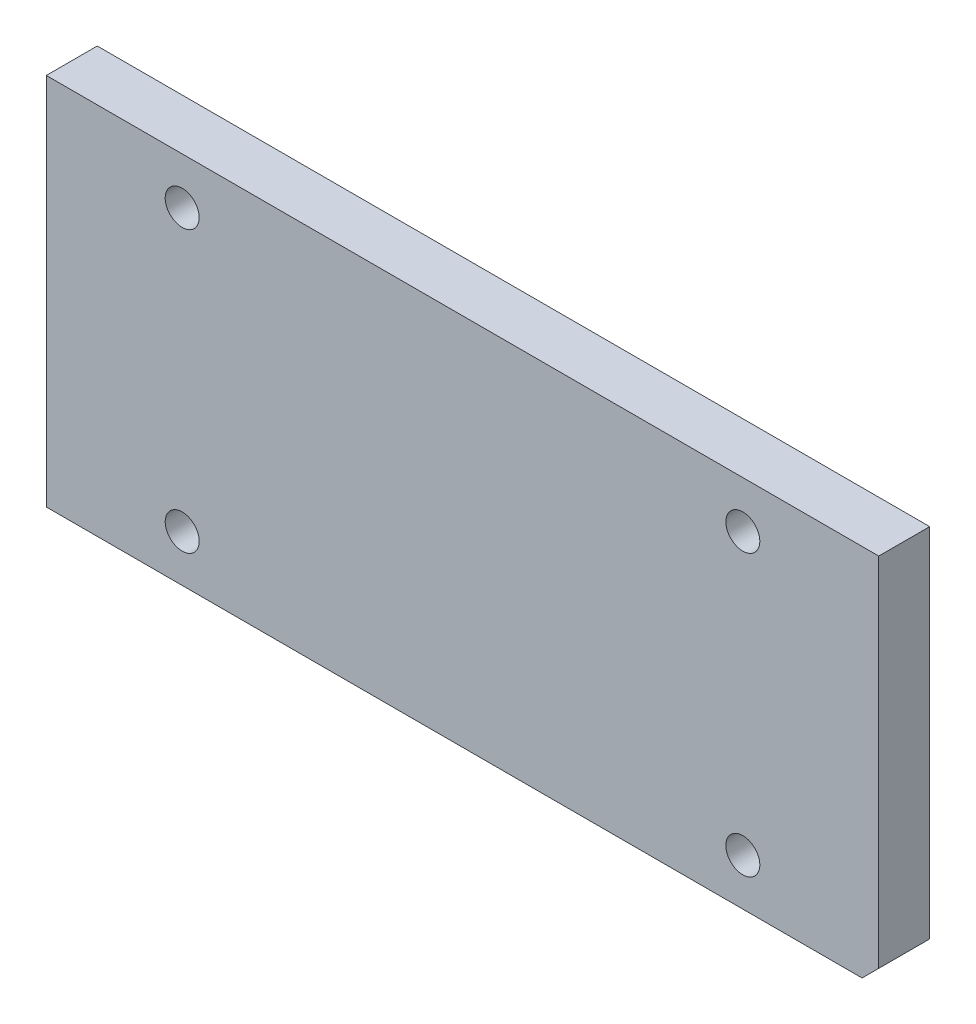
ISO-10303-21;
HEADER;
FILE_DESCRIPTION(('STEP AP214'),'2;1');
FILE_NAME('part.step','',(''),(''),'','','');
FILE_SCHEMA(('AUTOMOTIVE_DESIGN { 1 0 10303 214 1 1 1 1 }'));
ENDSEC;
DATA;
#1=APPLICATION_CONTEXT('core data for automotive mechanical design processes');
#2=APPLICATION_PROTOCOL_DEFINITION('international standard','automotive_design',2000,#1);
#3=PRODUCT_CONTEXT('',#1,'mechanical');
#4=PRODUCT('Part','Part','',(#3));
#5=PRODUCT_RELATED_PRODUCT_CATEGORY('part','',(#4));
#6=PRODUCT_DEFINITION_FORMATION('','',#4);
#7=PRODUCT_DEFINITION_CONTEXT('part definition',#1,'design');
#8=PRODUCT_DEFINITION('design','',#6,#7);
#9=PRODUCT_DEFINITION_SHAPE('','',#8);
#10=(LENGTH_UNIT() NAMED_UNIT(*) SI_UNIT(.MILLI.,.METRE.));
#11=(NAMED_UNIT(*) PLANE_ANGLE_UNIT() SI_UNIT($,.RADIAN.));
#12=(NAMED_UNIT(*) SI_UNIT($,.STERADIAN.) SOLID_ANGLE_UNIT());
#13=UNCERTAINTY_MEASURE_WITH_UNIT(LENGTH_MEASURE(1.E-05),#10,'distance_accuracy_value','');
#14=(GEOMETRIC_REPRESENTATION_CONTEXT(3) GLOBAL_UNCERTAINTY_ASSIGNED_CONTEXT((#13)) GLOBAL_UNIT_ASSIGNED_CONTEXT((#10,
#11,#12)) REPRESENTATION_CONTEXT('',''));
#15=CARTESIAN_POINT('',(0.,0.,0.));
#16=DIRECTION('',(0.,0.,1.));
#17=DIRECTION('',(1.,0.,0.));
#18=AXIS2_PLACEMENT_3D('',#15,#16,#17);
#19=CARTESIAN_POINT('',(-98.,-44.,-226.848784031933));
#20=DIRECTION('',(-1.,0.,0.));
#21=DIRECTION('',(0.,0.,1.));
#22=AXIS2_PLACEMENT_3D('',#19,#20,#21);
#23=PLANE('',#22);
#24=DIRECTION('',(0.,1.,0.));
#25=VECTOR('',#24,1.);
#26=CARTESIAN_POINT('',(-98.,-44.,-12.));
#27=LINE('',#26,#25);
#28=CARTESIAN_POINT('',(-98.,-44.,-12.));
#29=VERTEX_POINT('',#28);
#30=CARTESIAN_POINT('',(-98.,44.,-12.));
#31=VERTEX_POINT('',#30);
#32=EDGE_CURVE('E87',#29,#31,#27,.T.);
#33=ORIENTED_EDGE('',*,*,#32,.F.);
#34=DIRECTION('',(0.,0.,1.));
#35=VECTOR('',#34,1.);
#36=CARTESIAN_POINT('',(-98.,-44.,-226.848784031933));
#37=LINE('',#36,#35);
#38=CARTESIAN_POINT('',(-98.,-44.,0.));
#39=VERTEX_POINT('',#38);
#40=EDGE_CURVE('E81',#29,#39,#37,.T.);
#41=ORIENTED_EDGE('',*,*,#40,.T.);
#42=DIRECTION('',(0.,-1.,0.));
#43=VECTOR('',#42,1.);
#44=CARTESIAN_POINT('',(-98.,-44.,0.));
#45=LINE('',#44,#43);
#46=CARTESIAN_POINT('',(-98.,44.,0.));
#47=VERTEX_POINT('',#46);
#48=EDGE_CURVE('E85',#47,#39,#45,.T.);
#49=ORIENTED_EDGE('',*,*,#48,.F.);
#50=DIRECTION('',(0.,0.,1.));
#51=VECTOR('',#50,1.);
#52=CARTESIAN_POINT('',(-98.,44.,-226.848784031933));
#53=LINE('',#52,#51);
#54=EDGE_CURVE('E112',#31,#47,#53,.T.);
#55=ORIENTED_EDGE('',*,*,#54,.F.);
#56=EDGE_LOOP('',(#33,#41,#49,#55));
#57=FACE_BOUND('',#56,.T.);
#58=ADVANCED_FACE('F34',(#57),#23,.T.);
#59=CARTESIAN_POINT('',(-98.,44.,-226.848784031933));
#60=DIRECTION('',(0.,1.,0.));
#61=DIRECTION('',(0.,0.,1.));
#62=AXIS2_PLACEMENT_3D('',#59,#60,#61);
#63=PLANE('',#62);
#64=DIRECTION('',(1.,0.,0.));
#65=VECTOR('',#64,1.);
#66=CARTESIAN_POINT('',(-98.,44.,-12.));
#67=LINE('',#66,#65);
#68=CARTESIAN_POINT('',(98.,44.,-12.));
#69=VERTEX_POINT('',#68);
#70=EDGE_CURVE('E168',#31,#69,#67,.T.);
#71=ORIENTED_EDGE('',*,*,#70,.F.);
#72=ORIENTED_EDGE('',*,*,#54,.T.);
#73=DIRECTION('',(-1.,0.,0.));
#74=VECTOR('',#73,1.);
#75=CARTESIAN_POINT('',(-98.,44.,0.));
#76=LINE('',#75,#74);
#77=CARTESIAN_POINT('',(98.,44.,0.));
#78=VERTEX_POINT('',#77);
#79=EDGE_CURVE('E91',#78,#47,#76,.T.);
#80=ORIENTED_EDGE('',*,*,#79,.F.);
#81=DIRECTION('',(0.,0.,1.));
#82=VECTOR('',#81,1.);
#83=CARTESIAN_POINT('',(98.,44.,-226.848784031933));
#84=LINE('',#83,#82);
#85=EDGE_CURVE('E90',#69,#78,#84,.T.);
#86=ORIENTED_EDGE('',*,*,#85,.F.);
#87=EDGE_LOOP('',(#71,#72,#80,#86));
#88=FACE_BOUND('',#87,.T.);
#89=ADVANCED_FACE('F174',(#88),#63,.T.);
#90=CARTESIAN_POINT('',(98.,-44.,-226.848784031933));
#91=DIRECTION('',(1.,0.,0.));
#92=DIRECTION('',(0.,1.,0.));
#93=AXIS2_PLACEMENT_3D('',#90,#91,#92);
#94=PLANE('',#93);
#95=DIRECTION('',(0.,1.,0.));
#96=VECTOR('',#95,1.);
#97=CARTESIAN_POINT('',(98.,-44.,0.));
#98=LINE('',#97,#96);
#99=CARTESIAN_POINT('',(98.,-40.08,0.));
#100=VERTEX_POINT('',#99);
#101=EDGE_CURVE('E98',#100,#78,#98,.T.);
#102=ORIENTED_EDGE('',*,*,#101,.F.);
#103=DIRECTION('',(0.,0.,-1.));
#104=VECTOR('',#103,1.);
#105=CARTESIAN_POINT('',(98.,-40.08,-226.848784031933));
#106=LINE('',#105,#104);
#107=CARTESIAN_POINT('',(98.,-40.08,-12.));
#108=VERTEX_POINT('',#107);
#109=EDGE_CURVE('E42',#100,#108,#106,.T.);
#110=ORIENTED_EDGE('',*,*,#109,.T.);
#111=DIRECTION('',(0.,-1.,0.));
#112=VECTOR('',#111,1.);
#113=CARTESIAN_POINT('',(98.,-44.,-12.));
#114=LINE('',#113,#112);
#115=EDGE_CURVE('E114',#69,#108,#114,.T.);
#116=ORIENTED_EDGE('',*,*,#115,.F.);
#117=ORIENTED_EDGE('',*,*,#85,.T.);
#118=EDGE_LOOP('',(#102,#110,#116,#117));
#119=FACE_BOUND('',#118,.T.);
#120=ADVANCED_FACE('F175',(#119),#94,.T.);
#121=CARTESIAN_POINT('',(-98.,-44.,-226.848784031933));
#122=DIRECTION('',(0.,-1.,0.));
#123=DIRECTION('',(0.,0.,-1.));
#124=AXIS2_PLACEMENT_3D('',#121,#122,#123);
#125=PLANE('',#124);
#126=DIRECTION('',(-1.,0.,0.));
#127=VECTOR('',#126,1.);
#128=CARTESIAN_POINT('',(-98.,-44.,-12.));
#129=LINE('',#128,#127);
#130=CARTESIAN_POINT('',(94.08,-44.,-12.));
#131=VERTEX_POINT('',#130);
#132=EDGE_CURVE('E117',#131,#29,#129,.T.);
#133=ORIENTED_EDGE('',*,*,#132,.F.);
#134=DIRECTION('',(0.,0.,1.));
#135=VECTOR('',#134,1.);
#136=CARTESIAN_POINT('',(94.08,-44.,-226.848784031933));
#137=LINE('',#136,#135);
#138=CARTESIAN_POINT('',(94.08,-44.,0.));
#139=VERTEX_POINT('',#138);
#140=EDGE_CURVE('E97',#131,#139,#137,.T.);
#141=ORIENTED_EDGE('',*,*,#140,.T.);
#142=DIRECTION('',(1.,0.,0.));
#143=VECTOR('',#142,1.);
#144=CARTESIAN_POINT('',(-98.,-44.,0.));
#145=LINE('',#144,#143);
#146=EDGE_CURVE('E94',#39,#139,#145,.T.);
#147=ORIENTED_EDGE('',*,*,#146,.F.);
#148=ORIENTED_EDGE('',*,*,#40,.F.);
#149=EDGE_LOOP('',(#133,#141,#147,#148));
#150=FACE_BOUND('',#149,.T.);
#151=ADVANCED_FACE('F95',(#150),#125,.T.);
#152=CARTESIAN_POINT('',(0.,0.,0.));
#153=DIRECTION('',(0.,0.,-1.));
#154=DIRECTION('',(-1.,0.,0.));
#155=AXIS2_PLACEMENT_3D('',#152,#153,#154);
#156=PLANE('',#155);
#157=CARTESIAN_POINT('',(66.0000000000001,-33.,0.));
#158=DIRECTION('',(0.,0.,1.));
#159=DIRECTION('',(1.,0.,0.));
#160=AXIS2_PLACEMENT_3D('',#157,#158,#159);
#161=CIRCLE('',#160,4.);
#162=CARTESIAN_POINT('',(70.0000000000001,-33.,0.));
#163=VERTEX_POINT('',#162);
#164=EDGE_CURVE('E146',#163,#163,#161,.T.);
#165=ORIENTED_EDGE('',*,*,#164,.F.);
#166=EDGE_LOOP('',(#165));
#167=FACE_BOUND('',#166,.T.);
#168=CARTESIAN_POINT('',(-65.9999999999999,-33.,0.));
#169=DIRECTION('',(0.,0.,1.));
#170=DIRECTION('',(1.,0.,0.));
#171=AXIS2_PLACEMENT_3D('',#168,#169,#170);
#172=CIRCLE('',#171,4.);
#173=CARTESIAN_POINT('',(-61.9999999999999,-33.,0.));
#174=VERTEX_POINT('',#173);
#175=EDGE_CURVE('E132',#174,#174,#172,.T.);
#176=ORIENTED_EDGE('',*,*,#175,.F.);
#177=EDGE_LOOP('',(#176));
#178=FACE_BOUND('',#177,.T.);
#179=CARTESIAN_POINT('',(-65.9999999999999,33.,0.));
#180=DIRECTION('',(0.,0.,1.));
#181=DIRECTION('',(1.,0.,0.));
#182=AXIS2_PLACEMENT_3D('',#179,#180,#181);
#183=CIRCLE('',#182,4.);
#184=CARTESIAN_POINT('',(-61.9999999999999,33.,0.));
#185=VERTEX_POINT('',#184);
#186=EDGE_CURVE('E127',#185,#185,#183,.T.);
#187=ORIENTED_EDGE('',*,*,#186,.F.);
#188=EDGE_LOOP('',(#187));
#189=FACE_BOUND('',#188,.T.);
#190=CARTESIAN_POINT('',(66.0000000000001,33.,0.));
#191=DIRECTION('',(0.,0.,1.));
#192=DIRECTION('',(1.,0.,0.));
#193=AXIS2_PLACEMENT_3D('',#190,#191,#192);
#194=CIRCLE('',#193,4.);
#195=CARTESIAN_POINT('',(70.0000000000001,33.,0.));
#196=VERTEX_POINT('',#195);
#197=EDGE_CURVE('E122',#196,#196,#194,.T.);
#198=ORIENTED_EDGE('',*,*,#197,.F.);
#199=EDGE_LOOP('',(#198));
#200=FACE_BOUND('',#199,.T.);
#201=ORIENTED_EDGE('',*,*,#146,.T.);
#202=DIRECTION('',(-0.707106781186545,-0.70710678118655,0.));
#203=VECTOR('',#202,1.);
#204=CARTESIAN_POINT('',(94.08,-44.,0.));
#205=LINE('',#204,#203);
#206=EDGE_CURVE('E56',#139,#100,#205,.F.);
#207=ORIENTED_EDGE('',*,*,#206,.T.);
#208=ORIENTED_EDGE('',*,*,#101,.T.);
#209=ORIENTED_EDGE('',*,*,#79,.T.);
#210=ORIENTED_EDGE('',*,*,#48,.T.);
#211=EDGE_LOOP('',(#201,#207,#208,#209,#210));
#212=FACE_BOUND('',#211,.T.);
#213=ADVANCED_FACE('F100',(#167,#178,#189,#200,#212),#156,.F.);
#214=CARTESIAN_POINT('',(0.,0.,-12.));
#215=DIRECTION('',(0.,0.,1.));
#216=DIRECTION('',(1.,0.,0.));
#217=AXIS2_PLACEMENT_3D('',#214,#215,#216);
#218=PLANE('',#217);
#219=CARTESIAN_POINT('',(66.0000000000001,-33.,-12.));
#220=DIRECTION('',(0.,0.,1.));
#221=DIRECTION('',(1.,0.,0.));
#222=AXIS2_PLACEMENT_3D('',#219,#220,#221);
#223=CIRCLE('',#222,3.4);
#224=CARTESIAN_POINT('',(69.4000000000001,-33.,-12.));
#225=VERTEX_POINT('',#224);
#226=EDGE_CURVE('E129',#225,#225,#223,.T.);
#227=ORIENTED_EDGE('',*,*,#226,.T.);
#228=EDGE_LOOP('',(#227));
#229=FACE_BOUND('',#228,.T.);
#230=CARTESIAN_POINT('',(-65.9999999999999,-33.,-12.));
#231=DIRECTION('',(0.,0.,1.));
#232=DIRECTION('',(1.,0.,0.));
#233=AXIS2_PLACEMENT_3D('',#230,#231,#232);
#234=CIRCLE('',#233,3.4);
#235=CARTESIAN_POINT('',(-62.5999999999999,-33.,-12.));
#236=VERTEX_POINT('',#235);
#237=EDGE_CURVE('E124',#236,#236,#234,.T.);
#238=ORIENTED_EDGE('',*,*,#237,.T.);
#239=EDGE_LOOP('',(#238));
#240=FACE_BOUND('',#239,.T.);
#241=CARTESIAN_POINT('',(-65.9999999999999,33.,-12.));
#242=DIRECTION('',(0.,0.,1.));
#243=DIRECTION('',(1.,0.,0.));
#244=AXIS2_PLACEMENT_3D('',#241,#242,#243);
#245=CIRCLE('',#244,3.4);
#246=CARTESIAN_POINT('',(-62.5999999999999,33.,-12.));
#247=VERTEX_POINT('',#246);
#248=EDGE_CURVE('E119',#247,#247,#245,.T.);
#249=ORIENTED_EDGE('',*,*,#248,.T.);
#250=EDGE_LOOP('',(#249));
#251=FACE_BOUND('',#250,.T.);
#252=CARTESIAN_POINT('',(66.0000000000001,33.,-12.));
#253=DIRECTION('',(0.,0.,1.));
#254=DIRECTION('',(1.,0.,0.));
#255=AXIS2_PLACEMENT_3D('',#252,#253,#254);
#256=CIRCLE('',#255,3.4);
#257=CARTESIAN_POINT('',(69.4000000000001,33.,-12.));
#258=VERTEX_POINT('',#257);
#259=EDGE_CURVE('E102',#258,#258,#256,.T.);
#260=ORIENTED_EDGE('',*,*,#259,.T.);
#261=EDGE_LOOP('',(#260));
#262=FACE_BOUND('',#261,.T.);
#263=ORIENTED_EDGE('',*,*,#115,.T.);
#264=DIRECTION('',(0.707106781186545,0.70710678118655,0.));
#265=VECTOR('',#264,1.);
#266=CARTESIAN_POINT('',(94.08,-44.,-12.));
#267=LINE('',#266,#265);
#268=EDGE_CURVE('E11',#108,#131,#267,.F.);
#269=ORIENTED_EDGE('',*,*,#268,.T.);
#270=ORIENTED_EDGE('',*,*,#132,.T.);
#271=ORIENTED_EDGE('',*,*,#32,.T.);
#272=ORIENTED_EDGE('',*,*,#70,.T.);
#273=EDGE_LOOP('',(#263,#269,#270,#271,#272));
#274=FACE_BOUND('',#273,.T.);
#275=ADVANCED_FACE('F171',(#229,#240,#251,#262,#274),#218,.F.);
#276=CARTESIAN_POINT('',(66.0000000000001,33.,0.));
#277=DIRECTION('',(0.,0.,1.));
#278=DIRECTION('',(1.,0.,0.));
#279=AXIS2_PLACEMENT_3D('',#276,#277,#278);
#280=CYLINDRICAL_SURFACE('',#279,3.4);
#281=CARTESIAN_POINT('',(66.0000000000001,33.,-11.9));
#282=DIRECTION('',(0.,0.,1.));
#283=DIRECTION('',(1.,0.,0.));
#284=AXIS2_PLACEMENT_3D('',#281,#282,#283);
#285=CIRCLE('',#284,3.4);
#286=CARTESIAN_POINT('',(69.4000000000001,33.,-11.9));
#287=VERTEX_POINT('',#286);
#288=EDGE_CURVE('E105',#287,#287,#285,.T.);
#289=ORIENTED_EDGE('',*,*,#288,.T.);
#290=EDGE_LOOP('',(#289));
#291=FACE_BOUND('',#290,.T.);
#292=ORIENTED_EDGE('',*,*,#259,.F.);
#293=EDGE_LOOP('',(#292));
#294=FACE_BOUND('',#293,.T.);
#295=ADVANCED_FACE('F201',(#291,#294),#280,.F.);
#296=CARTESIAN_POINT('',(69.4000000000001,33.,-11.9));
#297=DIRECTION('',(0.,0.,-1.));
#298=DIRECTION('',(-1.,0.,0.));
#299=AXIS2_PLACEMENT_3D('',#296,#297,#298);
#300=PLANE('',#299);
#301=ORIENTED_EDGE('',*,*,#288,.F.);
#302=EDGE_LOOP('',(#301));
#303=FACE_BOUND('',#302,.T.);
#304=CARTESIAN_POINT('',(66.0000000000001,33.,-11.9));
#305=DIRECTION('',(0.,0.,1.));
#306=DIRECTION('',(1.,0.,0.));
#307=AXIS2_PLACEMENT_3D('',#304,#305,#306);
#308=CIRCLE('',#307,4.);
#309=CARTESIAN_POINT('',(70.0000000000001,33.,-11.9));
#310=VERTEX_POINT('',#309);
#311=EDGE_CURVE('E163',#310,#310,#308,.T.);
#312=ORIENTED_EDGE('',*,*,#311,.T.);
#313=EDGE_LOOP('',(#312));
#314=FACE_BOUND('',#313,.T.);
#315=ADVANCED_FACE('F204',(#303,#314),#300,.F.);
#316=CARTESIAN_POINT('',(66.0000000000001,33.,0.));
#317=DIRECTION('',(0.,0.,1.));
#318=DIRECTION('',(1.,0.,0.));
#319=AXIS2_PLACEMENT_3D('',#316,#317,#318);
#320=CYLINDRICAL_SURFACE('',#319,4.);
#321=ORIENTED_EDGE('',*,*,#311,.F.);
#322=EDGE_LOOP('',(#321));
#323=FACE_BOUND('',#322,.T.);
#324=ORIENTED_EDGE('',*,*,#197,.T.);
#325=EDGE_LOOP('',(#324));
#326=FACE_BOUND('',#325,.T.);
#327=ADVANCED_FACE('F208',(#323,#326),#320,.F.);
#328=CARTESIAN_POINT('',(-65.9999999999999,33.,0.));
#329=DIRECTION('',(0.,0.,1.));
#330=DIRECTION('',(1.,0.,0.));
#331=AXIS2_PLACEMENT_3D('',#328,#329,#330);
#332=CYLINDRICAL_SURFACE('',#331,3.4);
#333=CARTESIAN_POINT('',(-65.9999999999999,33.,-11.9));
#334=DIRECTION('',(0.,0.,1.));
#335=DIRECTION('',(1.,0.,0.));
#336=AXIS2_PLACEMENT_3D('',#333,#334,#335);
#337=CIRCLE('',#336,3.4);
#338=CARTESIAN_POINT('',(-62.5999999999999,33.,-11.9));
#339=VERTEX_POINT('',#338);
#340=EDGE_CURVE('E123',#339,#339,#337,.T.);
#341=ORIENTED_EDGE('',*,*,#340,.T.);
#342=EDGE_LOOP('',(#341));
#343=FACE_BOUND('',#342,.T.);
#344=ORIENTED_EDGE('',*,*,#248,.F.);
#345=EDGE_LOOP('',(#344));
#346=FACE_BOUND('',#345,.T.);
#347=ADVANCED_FACE('F212',(#343,#346),#332,.F.);
#348=CARTESIAN_POINT('',(-62.5999999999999,33.,-11.9));
#349=DIRECTION('',(0.,0.,-1.));
#350=DIRECTION('',(-1.,0.,0.));
#351=AXIS2_PLACEMENT_3D('',#348,#349,#350);
#352=PLANE('',#351);
#353=ORIENTED_EDGE('',*,*,#340,.F.);
#354=EDGE_LOOP('',(#353));
#355=FACE_BOUND('',#354,.T.);
#356=CARTESIAN_POINT('',(-65.9999999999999,33.,-11.9));
#357=DIRECTION('',(0.,0.,1.));
#358=DIRECTION('',(1.,0.,0.));
#359=AXIS2_PLACEMENT_3D('',#356,#357,#358);
#360=CIRCLE('',#359,4.);
#361=CARTESIAN_POINT('',(-61.9999999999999,33.,-11.9));
#362=VERTEX_POINT('',#361);
#363=EDGE_CURVE('E156',#362,#362,#360,.T.);
#364=ORIENTED_EDGE('',*,*,#363,.T.);
#365=EDGE_LOOP('',(#364));
#366=FACE_BOUND('',#365,.T.);
#367=ADVANCED_FACE('F216',(#355,#366),#352,.F.);
#368=CARTESIAN_POINT('',(-65.9999999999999,33.,0.));
#369=DIRECTION('',(0.,0.,1.));
#370=DIRECTION('',(1.,0.,0.));
#371=AXIS2_PLACEMENT_3D('',#368,#369,#370);
#372=CYLINDRICAL_SURFACE('',#371,4.);
#373=ORIENTED_EDGE('',*,*,#363,.F.);
#374=EDGE_LOOP('',(#373));
#375=FACE_BOUND('',#374,.T.);
#376=ORIENTED_EDGE('',*,*,#186,.T.);
#377=EDGE_LOOP('',(#376));
#378=FACE_BOUND('',#377,.T.);
#379=ADVANCED_FACE('F220',(#375,#378),#372,.F.);
#380=CARTESIAN_POINT('',(-65.9999999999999,-33.,0.));
#381=DIRECTION('',(0.,0.,1.));
#382=DIRECTION('',(1.,0.,0.));
#383=AXIS2_PLACEMENT_3D('',#380,#381,#382);
#384=CYLINDRICAL_SURFACE('',#383,3.4);
#385=CARTESIAN_POINT('',(-65.9999999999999,-33.,-11.9));
#386=DIRECTION('',(0.,0.,1.));
#387=DIRECTION('',(1.,0.,0.));
#388=AXIS2_PLACEMENT_3D('',#385,#386,#387);
#389=CIRCLE('',#388,3.4);
#390=CARTESIAN_POINT('',(-62.5999999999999,-33.,-11.9));
#391=VERTEX_POINT('',#390);
#392=EDGE_CURVE('E128',#391,#391,#389,.T.);
#393=ORIENTED_EDGE('',*,*,#392,.T.);
#394=EDGE_LOOP('',(#393));
#395=FACE_BOUND('',#394,.T.);
#396=ORIENTED_EDGE('',*,*,#237,.F.);
#397=EDGE_LOOP('',(#396));
#398=FACE_BOUND('',#397,.T.);
#399=ADVANCED_FACE('F224',(#395,#398),#384,.F.);
#400=CARTESIAN_POINT('',(-62.5999999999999,-33.,-11.9));
#401=DIRECTION('',(0.,0.,-1.));
#402=DIRECTION('',(-1.,0.,0.));
#403=AXIS2_PLACEMENT_3D('',#400,#401,#402);
#404=PLANE('',#403);
#405=ORIENTED_EDGE('',*,*,#392,.F.);
#406=EDGE_LOOP('',(#405));
#407=FACE_BOUND('',#406,.T.);
#408=CARTESIAN_POINT('',(-65.9999999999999,-33.,-11.9));
#409=DIRECTION('',(0.,0.,1.));
#410=DIRECTION('',(1.,0.,0.));
#411=AXIS2_PLACEMENT_3D('',#408,#409,#410);
#412=CIRCLE('',#411,4.);
#413=CARTESIAN_POINT('',(-61.9999999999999,-33.,-11.9));
#414=VERTEX_POINT('',#413);
#415=EDGE_CURVE('E138',#414,#414,#412,.T.);
#416=ORIENTED_EDGE('',*,*,#415,.T.);
#417=EDGE_LOOP('',(#416));
#418=FACE_BOUND('',#417,.T.);
#419=ADVANCED_FACE('F228',(#407,#418),#404,.F.);
#420=CARTESIAN_POINT('',(-65.9999999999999,-33.,0.));
#421=DIRECTION('',(0.,0.,1.));
#422=DIRECTION('',(1.,0.,0.));
#423=AXIS2_PLACEMENT_3D('',#420,#421,#422);
#424=CYLINDRICAL_SURFACE('',#423,4.);
#425=ORIENTED_EDGE('',*,*,#415,.F.);
#426=EDGE_LOOP('',(#425));
#427=FACE_BOUND('',#426,.T.);
#428=ORIENTED_EDGE('',*,*,#175,.T.);
#429=EDGE_LOOP('',(#428));
#430=FACE_BOUND('',#429,.T.);
#431=ADVANCED_FACE('F232',(#427,#430),#424,.F.);
#432=CARTESIAN_POINT('',(66.0000000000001,-33.,0.));
#433=DIRECTION('',(0.,0.,1.));
#434=DIRECTION('',(1.,0.,0.));
#435=AXIS2_PLACEMENT_3D('',#432,#433,#434);
#436=CYLINDRICAL_SURFACE('',#435,3.4);
#437=CARTESIAN_POINT('',(66.0000000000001,-33.,-11.9));
#438=DIRECTION('',(0.,0.,1.));
#439=DIRECTION('',(1.,0.,0.));
#440=AXIS2_PLACEMENT_3D('',#437,#438,#439);
#441=CIRCLE('',#440,3.4);
#442=CARTESIAN_POINT('',(69.4000000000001,-33.,-11.9));
#443=VERTEX_POINT('',#442);
#444=EDGE_CURVE('E133',#443,#443,#441,.T.);
#445=ORIENTED_EDGE('',*,*,#444,.T.);
#446=EDGE_LOOP('',(#445));
#447=FACE_BOUND('',#446,.T.);
#448=ORIENTED_EDGE('',*,*,#226,.F.);
#449=EDGE_LOOP('',(#448));
#450=FACE_BOUND('',#449,.T.);
#451=ADVANCED_FACE('F236',(#447,#450),#436,.F.);
#452=CARTESIAN_POINT('',(69.4000000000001,-33.,-11.9));
#453=DIRECTION('',(0.,0.,-1.));
#454=DIRECTION('',(-1.,0.,0.));
#455=AXIS2_PLACEMENT_3D('',#452,#453,#454);
#456=PLANE('',#455);
#457=ORIENTED_EDGE('',*,*,#444,.F.);
#458=EDGE_LOOP('',(#457));
#459=FACE_BOUND('',#458,.T.);
#460=CARTESIAN_POINT('',(66.0000000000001,-33.,-11.9));
#461=DIRECTION('',(0.,0.,1.));
#462=DIRECTION('',(1.,0.,0.));
#463=AXIS2_PLACEMENT_3D('',#460,#461,#462);
#464=CIRCLE('',#463,4.);
#465=CARTESIAN_POINT('',(70.0000000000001,-33.,-11.9));
#466=VERTEX_POINT('',#465);
#467=EDGE_CURVE('E141',#466,#466,#464,.T.);
#468=ORIENTED_EDGE('',*,*,#467,.T.);
#469=EDGE_LOOP('',(#468));
#470=FACE_BOUND('',#469,.T.);
#471=ADVANCED_FACE('F183',(#459,#470),#456,.F.);
#472=CARTESIAN_POINT('',(66.0000000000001,-33.,0.));
#473=DIRECTION('',(0.,0.,1.));
#474=DIRECTION('',(1.,0.,0.));
#475=AXIS2_PLACEMENT_3D('',#472,#473,#474);
#476=CYLINDRICAL_SURFACE('',#475,4.);
#477=ORIENTED_EDGE('',*,*,#467,.F.);
#478=EDGE_LOOP('',(#477));
#479=FACE_BOUND('',#478,.T.);
#480=ORIENTED_EDGE('',*,*,#164,.T.);
#481=EDGE_LOOP('',(#480));
#482=FACE_BOUND('',#481,.T.);
#483=ADVANCED_FACE('F179',(#479,#482),#476,.F.);
#484=CARTESIAN_POINT('',(94.08,-44.,-226.848784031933));
#485=DIRECTION('',(-0.70710678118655,0.707106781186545,0.));
#486=DIRECTION('',(0.,0.,1.));
#487=AXIS2_PLACEMENT_3D('',#484,#485,#486);
#488=PLANE('',#487);
#489=ORIENTED_EDGE('',*,*,#268,.F.);
#490=ORIENTED_EDGE('',*,*,#109,.F.);
#491=ORIENTED_EDGE('',*,*,#206,.F.);
#492=ORIENTED_EDGE('',*,*,#140,.F.);
#493=EDGE_LOOP('',(#489,#490,#491,#492));
#494=FACE_BOUND('',#493,.T.);
#495=ADVANCED_FACE('F36',(#494),#488,.F.);
#496=CLOSED_SHELL('',(#58,#89,#120,#151,#213,#275,#295,#315,#327,#347,#367,#379,#399,#419,#431,
#451,#471,#483,#495));
#497=MANIFOLD_SOLID_BREP('B2',#496);
#498=ADVANCED_BREP_SHAPE_REPRESENTATION('',(#18,#497),#14);
#499=SHAPE_DEFINITION_REPRESENTATION(#9,#498);
ENDSEC;
END-ISO-10303-21;
